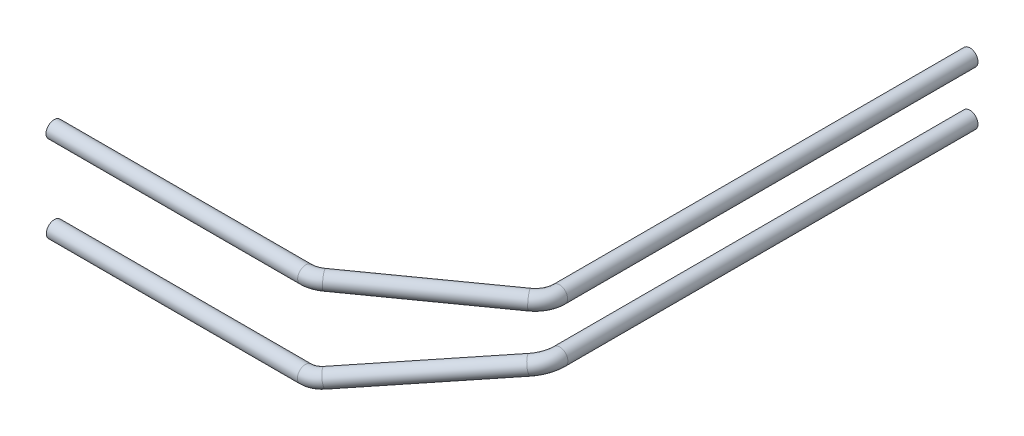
from build123d import *

# Parameters (mm, degrees)
PROFILE_R                                 = 19.05
PROFILE_R_2                               = 17.399
STAINLESS_ROUND_TUBE_1_50_X_065_1_DEPTH   = 592.060967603
PROFILE_ON_SEGMENT_2_R                    = 19.05
PROFILE_ON_SEGMENT_2_R_2                  = 17.399
STAINLESS_ROUND_TUBE_1_50_X_065_1_2_ANGLE = 35.485238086
PROFILE_ON_SEGMENT_3_R                    = 19.05
PROFILE_ON_SEGMENT_3_R_2                  = 17.399
STAINLESS_ROUND_TUBE_1_50_X_065_1_3_DEPTH = 346.073830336
PROFILE_ON_SEGMENT_4_R                    = 19.05
PROFILE_ON_SEGMENT_4_R_2                  = 17.399
STAINLESS_ROUND_TUBE_1_50_X_065_1_4_ANGLE = 54.514761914
PROFILE_ON_SEGMENT_5_R                    = 19.05
PROFILE_ON_SEGMENT_5_R_2                  = 17.399
STAINLESS_ROUND_TUBE_1_50_X_065_1_5_DEPTH = 965.391313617
PROFILE1_R                                = 19.05
PROFILE1_R_2                              = 17.399
STAINLESS_ROUND_TUBE_1_50_X_065_2_DEPTH   = 590.520202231
PROFILE1_ON_SEGMENT_2_R                   = 19.05
PROFILE1_ON_SEGMENT_2_R_2                 = 17.399
STAINLESS_ROUND_TUBE_1_50_X_065_2_2_ANGLE = 36.923662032
PROFILE1_ON_SEGMENT_3_R                   = 19.05
PROFILE1_ON_SEGMENT_3_R_2                 = 17.399
STAINLESS_ROUND_TUBE_1_50_X_065_2_3_DEPTH = 352.115420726
PROFILE1_ON_SEGMENT_4_R                   = 19.05
PROFILE1_ON_SEGMENT_4_R_2                 = 17.399
STAINLESS_ROUND_TUBE_1_50_X_065_2_4_ANGLE = 55.255220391
PROFILE1_ON_SEGMENT_5_R                   = 19.05
PROFILE1_ON_SEGMENT_5_R_2                 = 17.399
STAINLESS_ROUND_TUBE_1_50_X_065_2_5_DEPTH = 964.922439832


with BuildPart() as part:
    # Profile → Stainless round tube 1.50 X .065_1 (new body)
    with BuildSketch(Plane(origin=(-296.006811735, 127, 635), x_dir=(0, 0, -1), z_dir=(1, 0, 0))):
        Circle(PROFILE_R)
        Circle(PROFILE_R_2, mode=Mode.SUBTRACT)
    extrude(amount=STAINLESS_ROUND_TUBE_1_50_X_065_1_DEPTH)


with BuildPart() as body_2:
    # Profile on segment 2 (on carried to the start of arc 2) → Stainless round tube 1.50 X .065_1 2 (revolve)
    with BuildSketch(Plane(origin=(296.054155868, 127, 635), x_dir=(0, 0, -1), z_dir=(1, 0, 0))):
        Circle(PROFILE_ON_SEGMENT_2_R)
        Circle(PROFILE_ON_SEGMENT_2_R_2, mode=Mode.SUBTRACT)
    revolve(axis=Axis((296.054155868, 127, 577.85), (0, 1, 0)), revolution_arc=STAINLESS_ROUND_TUBE_1_50_X_065_1_2_ANGLE)


with BuildPart() as body_3:
    # Profile on segment 3 (on carried to segment 3) → Stainless round tube 1.50 X .065_1 3 (new body)
    with BuildSketch(Plane(origin=(329.22934136, 127, 624.385250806), x_dir=(-0.580493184, 0, -0.814265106), z_dir=(0.814265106, 0, -0.580493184))):
        Circle(PROFILE_ON_SEGMENT_3_R)
        Circle(PROFILE_ON_SEGMENT_3_R_2, mode=Mode.SUBTRACT)
    extrude(amount=STAINLESS_ROUND_TUBE_1_50_X_065_1_3_DEPTH)


with BuildPart() as body_4:
    # Profile on segment 4 (on carried to the start of arc 4) → Stainless round tube 1.50 X .065_1 4 (revolve)
    with BuildSketch(Plane(origin=(611.025185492, 127, 423.491750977), x_dir=(-0.580493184, 0, -0.814265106), z_dir=(0.814265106, 0, -0.580493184))):
        Circle(PROFILE_ON_SEGMENT_4_R)
        Circle(PROFILE_ON_SEGMENT_4_R_2, mode=Mode.SUBTRACT)
    revolve(axis=Axis((577.85, 127, 376.956500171), (0, 1, 0)), revolution_arc=STAINLESS_ROUND_TUBE_1_50_X_065_1_4_ANGLE)


with BuildPart() as body_5:
    # Profile on segment 5 (on carried to segment 5) → Stainless round tube 1.50 X .065_1 5 (new body)
    with BuildSketch(Plane(origin=(635, 127, 376.956500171), x_dir=(-1, 0, 0), z_dir=(0, 0, -1))):
        Circle(PROFILE_ON_SEGMENT_5_R)
        Circle(PROFILE_ON_SEGMENT_5_R_2, mode=Mode.SUBTRACT)
    extrude(amount=STAINLESS_ROUND_TUBE_1_50_X_065_1_5_DEPTH)


with BuildPart() as part_1:
    add(part.part)

    # Stainless round tube 1.50 X .065_1 as on: union body 2, body 3, body 4, body 5
    add(body_2.part)
    add(body_3.part)
    add(body_4.part)
    add(body_5.part)


with BuildPart() as body_2_2:
    # Profile1 → Stainless round tube 1.50 X .065_2 (new body)
    with BuildSketch(Plane(origin=(-295.260101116, -76.2, 635), x_dir=(0, 0, -1), z_dir=(1, 0, 0))):
        Circle(PROFILE1_R)
        Circle(PROFILE1_R_2, mode=Mode.SUBTRACT)
    extrude(amount=STAINLESS_ROUND_TUBE_1_50_X_065_2_DEPTH)


with BuildPart() as body_3_2:
    # Profile1 on segment 2 (on carried to the start of arc 2) → Stainless round tube 1.50 X .065_2 2 (revolve)
    with BuildSketch(Plane(origin=(295.260101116, -76.2, 635), x_dir=(0, 0, -1), z_dir=(1, 0, 0))):
        Circle(PROFILE1_ON_SEGMENT_2_R)
        Circle(PROFILE1_ON_SEGMENT_2_R_2, mode=Mode.SUBTRACT)
    revolve(axis=Axis((295.260101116, -58.127583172, 580.782749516), (0, 0.948683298, 0.316227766)), revolution_arc=STAINLESS_ROUND_TUBE_1_50_X_065_2_2_ANGLE)


with BuildPart() as body_4_2:
    # Profile1 on segment 3 (on carried to segment 3) → Stainless round tube 1.50 X .065_2 3 (new body)
    with BuildSketch(Plane(origin=(329.592988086, -72.57533515, 624.126005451), x_dir=(-0.569921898, -0.060169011, -0.819492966), z_dir=(0.799436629, 0.189973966, -0.569921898))):
        Circle(PROFILE1_ON_SEGMENT_3_R)
        Circle(PROFILE1_ON_SEGMENT_3_R_2, mode=Mode.SUBTRACT)
    extrude(amount=STAINLESS_ROUND_TUBE_1_50_X_065_2_3_DEPTH)


with BuildPart() as body_5_2:
    # Profile1 on segment 4 (on carried to the start of arc 4) → Stainless round tube 1.50 X .065_2 4 (revolve)
    with BuildSketch(Plane(origin=(635, 0, 376.487626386), x_dir=(1, 0, 0), z_dir=(0, 0, 1))):
        Circle(PROFILE1_ON_SEGMENT_4_R)
        Circle(PROFILE1_ON_SEGMENT_4_R_2, mode=Mode.SUBTRACT)
    revolve(axis=Axis((579.398361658, -13.212884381, 376.487626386), (0.231196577, -0.972907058, 0)), revolution_arc=STAINLESS_ROUND_TUBE_1_50_X_065_2_4_ANGLE)


with BuildPart() as body_6:
    # Profile1 on segment 5 (on carried to segment 5) → Stainless round tube 1.50 X .065_2 5 (new body)
    with BuildSketch(Plane(origin=(635, 0, 376.487626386), x_dir=(-1, 0, 0), z_dir=(0, 0, -1))):
        Circle(PROFILE1_ON_SEGMENT_5_R)
        Circle(PROFILE1_ON_SEGMENT_5_R_2, mode=Mode.SUBTRACT)
    extrude(amount=STAINLESS_ROUND_TUBE_1_50_X_065_2_5_DEPTH)


with BuildPart() as body_2_2_1:
    add(body_2_2.part)

    # Stainless round tube 1.50 X .065_2 as on: union body 3 2, body 4 2, body 5 2, body 6
    add(body_3_2.part)
    add(body_4_2.part)
    add(body_5_2.part)
    add(body_6.part)


solid = Compound([part_1.part, body_2_2_1.part])
